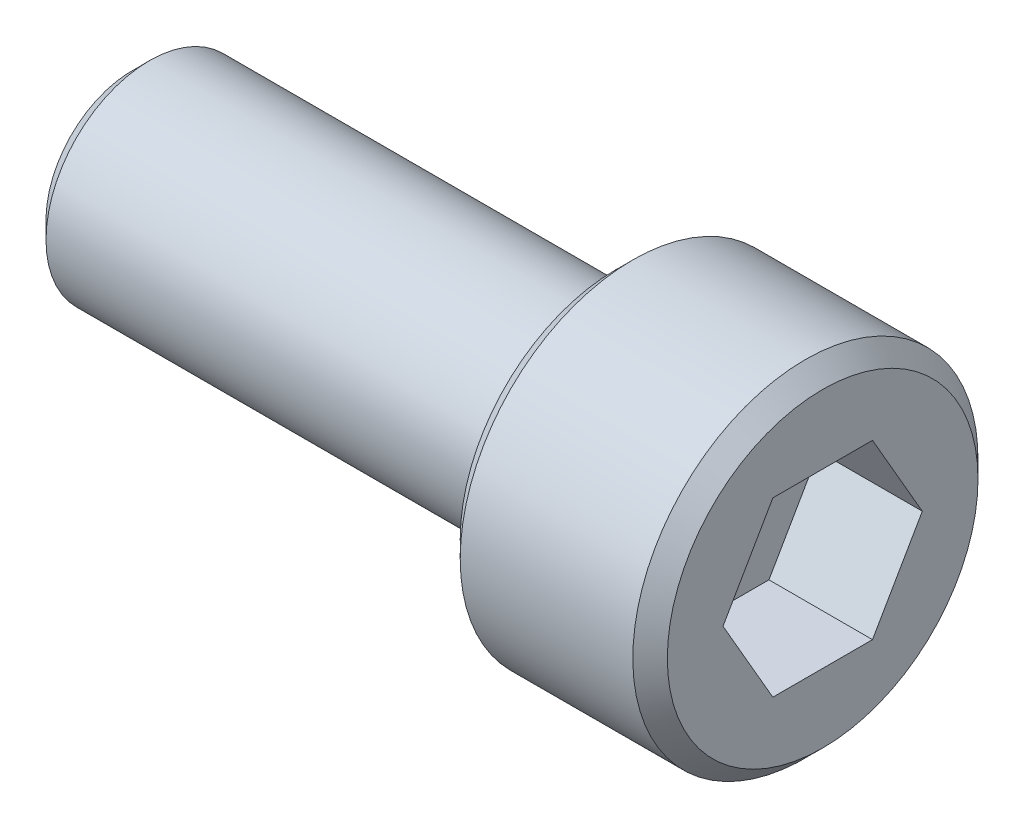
ISO-10303-21;
HEADER;
FILE_DESCRIPTION(('STEP AP214'),'2;1');
FILE_NAME('part.step','',(''),(''),'','','');
FILE_SCHEMA(('AUTOMOTIVE_DESIGN { 1 0 10303 214 1 1 1 1 }'));
ENDSEC;
DATA;
#1=APPLICATION_CONTEXT('core data for automotive mechanical design processes');
#2=APPLICATION_PROTOCOL_DEFINITION('international standard','automotive_design',2000,#1);
#3=PRODUCT_CONTEXT('',#1,'mechanical');
#4=PRODUCT('Part','Part','',(#3));
#5=PRODUCT_RELATED_PRODUCT_CATEGORY('part','',(#4));
#6=PRODUCT_DEFINITION_FORMATION('','',#4);
#7=PRODUCT_DEFINITION_CONTEXT('part definition',#1,'design');
#8=PRODUCT_DEFINITION('design','',#6,#7);
#9=PRODUCT_DEFINITION_SHAPE('','',#8);
#10=(LENGTH_UNIT() NAMED_UNIT(*) SI_UNIT(.MILLI.,.METRE.));
#11=(NAMED_UNIT(*) PLANE_ANGLE_UNIT() SI_UNIT($,.RADIAN.));
#12=(NAMED_UNIT(*) SI_UNIT($,.STERADIAN.) SOLID_ANGLE_UNIT());
#13=UNCERTAINTY_MEASURE_WITH_UNIT(LENGTH_MEASURE(1.E-05),#10,'distance_accuracy_value','');
#14=(GEOMETRIC_REPRESENTATION_CONTEXT(3) GLOBAL_UNCERTAINTY_ASSIGNED_CONTEXT((#13)) GLOBAL_UNIT_ASSIGNED_CONTEXT((#10,
#11,#12)) REPRESENTATION_CONTEXT('',''));
#15=CARTESIAN_POINT('',(0.,0.,0.));
#16=DIRECTION('',(0.,0.,1.));
#17=DIRECTION('',(1.,0.,0.));
#18=AXIS2_PLACEMENT_3D('',#15,#16,#17);
#19=CARTESIAN_POINT('',(-20.,0.,0.));
#20=DIRECTION('',(-1.,0.,0.));
#21=DIRECTION('',(0.,-1.,0.));
#22=AXIS2_PLACEMENT_3D('',#19,#20,#21);
#23=PLANE('',#22);
#24=CARTESIAN_POINT('',(-20.,0.,0.));
#25=DIRECTION('',(-1.,0.,0.));
#26=DIRECTION('',(0.,-1.,0.));
#27=AXIS2_PLACEMENT_3D('',#24,#25,#26);
#28=CIRCLE('',#27,2.5);
#29=CARTESIAN_POINT('',(-20.,-2.5,0.));
#30=VERTEX_POINT('',#29);
#31=EDGE_CURVE('E11',#30,#30,#28,.T.);
#32=ORIENTED_EDGE('',*,*,#31,.T.);
#33=EDGE_LOOP('',(#32));
#34=FACE_BOUND('',#33,.T.);
#35=ADVANCED_FACE('F43',(#34),#23,.T.);
#36=CARTESIAN_POINT('',(0.,0.,0.));
#37=DIRECTION('',(1.,0.,0.));
#38=DIRECTION('',(0.,1.,0.));
#39=AXIS2_PLACEMENT_3D('',#36,#37,#38);
#40=CYLINDRICAL_SURFACE('',#39,2.99999999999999);
#41=CARTESIAN_POINT('',(-19.5,0.,0.));
#42=DIRECTION('',(-1.,0.,0.));
#43=DIRECTION('',(0.,-1.,0.));
#44=AXIS2_PLACEMENT_3D('',#41,#42,#43);
#45=CIRCLE('',#44,2.99999999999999);
#46=CARTESIAN_POINT('',(-19.5,-3.,0.));
#47=VERTEX_POINT('',#46);
#48=EDGE_CURVE('E53',#47,#47,#45,.F.);
#49=ORIENTED_EDGE('',*,*,#48,.T.);
#50=EDGE_LOOP('',(#49));
#51=FACE_BOUND('',#50,.T.);
#52=CARTESIAN_POINT('',(-6.,0.,0.));
#53=DIRECTION('',(1.,0.,0.));
#54=DIRECTION('',(0.,1.,0.));
#55=AXIS2_PLACEMENT_3D('',#52,#53,#54);
#56=CIRCLE('',#55,2.99999999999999);
#57=CARTESIAN_POINT('',(-6.,2.99999999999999,0.));
#58=VERTEX_POINT('',#57);
#59=EDGE_CURVE('E159',#58,#58,#56,.T.);
#60=ORIENTED_EDGE('',*,*,#59,.F.);
#61=EDGE_LOOP('',(#60));
#62=FACE_BOUND('',#61,.T.);
#63=ADVANCED_FACE('F191',(#51,#62),#40,.T.);
#64=CARTESIAN_POINT('',(-6.,2.99999999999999,0.));
#65=DIRECTION('',(-1.,0.,0.));
#66=DIRECTION('',(0.,-1.,0.));
#67=AXIS2_PLACEMENT_3D('',#64,#65,#66);
#68=PLANE('',#67);
#69=CARTESIAN_POINT('',(-6.,0.,0.));
#70=DIRECTION('',(-1.,0.,0.));
#71=DIRECTION('',(0.,-1.,0.));
#72=AXIS2_PLACEMENT_3D('',#69,#70,#71);
#73=CIRCLE('',#72,4.50000000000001);
#74=CARTESIAN_POINT('',(-6.,-4.50000000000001,0.));
#75=VERTEX_POINT('',#74);
#76=EDGE_CURVE('E184',#75,#75,#73,.T.);
#77=ORIENTED_EDGE('',*,*,#76,.T.);
#78=EDGE_LOOP('',(#77));
#79=FACE_BOUND('',#78,.T.);
#80=ORIENTED_EDGE('',*,*,#59,.T.);
#81=EDGE_LOOP('',(#80));
#82=FACE_BOUND('',#81,.T.);
#83=ADVANCED_FACE('F209',(#79,#82),#68,.T.);
#84=CARTESIAN_POINT('',(0.,0.,0.));
#85=DIRECTION('',(1.,0.,0.));
#86=DIRECTION('',(0.,1.,0.));
#87=AXIS2_PLACEMENT_3D('',#84,#85,#86);
#88=CYLINDRICAL_SURFACE('',#87,5.);
#89=CARTESIAN_POINT('',(-0.499999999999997,0.,0.));
#90=DIRECTION('',(1.,0.,0.));
#91=DIRECTION('',(0.,1.,0.));
#92=AXIS2_PLACEMENT_3D('',#89,#90,#91);
#93=CIRCLE('',#92,5.);
#94=CARTESIAN_POINT('',(-0.499999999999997,5.,0.));
#95=VERTEX_POINT('',#94);
#96=EDGE_CURVE('E180',#95,#95,#93,.F.);
#97=ORIENTED_EDGE('',*,*,#96,.T.);
#98=EDGE_LOOP('',(#97));
#99=FACE_BOUND('',#98,.T.);
#100=CARTESIAN_POINT('',(-5.50000000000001,0.,0.));
#101=DIRECTION('',(-1.,0.,0.));
#102=DIRECTION('',(0.,-1.,0.));
#103=AXIS2_PLACEMENT_3D('',#100,#101,#102);
#104=CIRCLE('',#103,5.);
#105=CARTESIAN_POINT('',(-5.50000000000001,-5.,0.));
#106=VERTEX_POINT('',#105);
#107=EDGE_CURVE('E176',#106,#106,#104,.F.);
#108=ORIENTED_EDGE('',*,*,#107,.T.);
#109=EDGE_LOOP('',(#108));
#110=FACE_BOUND('',#109,.T.);
#111=ADVANCED_FACE('F236',(#99,#110),#88,.T.);
#112=CARTESIAN_POINT('',(0.,5.,0.));
#113=DIRECTION('',(1.,0.,0.));
#114=DIRECTION('',(0.,1.,0.));
#115=AXIS2_PLACEMENT_3D('',#112,#113,#114);
#116=PLANE('',#115);
#117=CARTESIAN_POINT('',(0.,0.,0.));
#118=DIRECTION('',(1.,0.,0.));
#119=DIRECTION('',(0.,1.,0.));
#120=AXIS2_PLACEMENT_3D('',#117,#118,#119);
#121=CIRCLE('',#120,4.50000000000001);
#122=CARTESIAN_POINT('',(0.,4.50000000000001,0.));
#123=VERTEX_POINT('',#122);
#124=EDGE_CURVE('E172',#123,#123,#121,.T.);
#125=ORIENTED_EDGE('',*,*,#124,.T.);
#126=EDGE_LOOP('',(#125));
#127=FACE_BOUND('',#126,.T.);
#128=DIRECTION('',(0.,0.866025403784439,-0.5));
#129=VECTOR('',#128,1.);
#130=CARTESIAN_POINT('',(0.,-2.5,-1.44337567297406));
#131=LINE('',#130,#129);
#132=CARTESIAN_POINT('',(0.,-2.5,-1.44337567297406));
#133=VERTEX_POINT('',#132);
#134=CARTESIAN_POINT('',(0.,0.,-2.88675134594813));
#135=VERTEX_POINT('',#134);
#136=EDGE_CURVE('E60',#133,#135,#131,.T.);
#137=ORIENTED_EDGE('',*,*,#136,.F.);
#138=DIRECTION('',(0.,0.,-1.));
#139=VECTOR('',#138,1.);
#140=CARTESIAN_POINT('',(0.,-2.5,1.44337567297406));
#141=LINE('',#140,#139);
#142=CARTESIAN_POINT('',(0.,-2.5,1.44337567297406));
#143=VERTEX_POINT('',#142);
#144=EDGE_CURVE('E153',#143,#133,#141,.T.);
#145=ORIENTED_EDGE('',*,*,#144,.F.);
#146=DIRECTION('',(0.,-0.866025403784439,-0.5));
#147=VECTOR('',#146,1.);
#148=CARTESIAN_POINT('',(0.,0.,2.88675134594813));
#149=LINE('',#148,#147);
#150=CARTESIAN_POINT('',(0.,0.,2.88675134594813));
#151=VERTEX_POINT('',#150);
#152=EDGE_CURVE('E150',#151,#143,#149,.T.);
#153=ORIENTED_EDGE('',*,*,#152,.F.);
#154=DIRECTION('',(0.,-0.866025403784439,0.5));
#155=VECTOR('',#154,1.);
#156=CARTESIAN_POINT('',(0.,2.5,1.44337567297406));
#157=LINE('',#156,#155);
#158=CARTESIAN_POINT('',(0.,2.5,1.44337567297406));
#159=VERTEX_POINT('',#158);
#160=EDGE_CURVE('E108',#159,#151,#157,.T.);
#161=ORIENTED_EDGE('',*,*,#160,.F.);
#162=DIRECTION('',(0.,0.,1.));
#163=VECTOR('',#162,1.);
#164=CARTESIAN_POINT('',(0.,2.5,-1.44337567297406));
#165=LINE('',#164,#163);
#166=CARTESIAN_POINT('',(0.,2.5,-1.44337567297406));
#167=VERTEX_POINT('',#166);
#168=EDGE_CURVE('E144',#167,#159,#165,.T.);
#169=ORIENTED_EDGE('',*,*,#168,.F.);
#170=DIRECTION('',(0.,0.866025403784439,0.5));
#171=VECTOR('',#170,1.);
#172=CARTESIAN_POINT('',(0.,0.,-2.88675134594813));
#173=LINE('',#172,#171);
#174=EDGE_CURVE('E140',#135,#167,#173,.T.);
#175=ORIENTED_EDGE('',*,*,#174,.F.);
#176=EDGE_LOOP('',(#137,#145,#153,#161,#169,#175));
#177=FACE_BOUND('',#176,.T.);
#178=ADVANCED_FACE('F232',(#127,#177),#116,.T.);
#179=CARTESIAN_POINT('',(-3.,-2.5,-1.44337567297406));
#180=DIRECTION('',(0.,-0.5,-0.866025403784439));
#181=DIRECTION('',(0.,0.866025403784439,-0.5));
#182=AXIS2_PLACEMENT_3D('',#179,#180,#181);
#183=PLANE('',#182);
#184=ORIENTED_EDGE('',*,*,#136,.T.);
#185=DIRECTION('',(1.,0.,0.));
#186=VECTOR('',#185,1.);
#187=CARTESIAN_POINT('',(-3.,0.,-2.88675134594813));
#188=LINE('',#187,#186);
#189=CARTESIAN_POINT('',(-3.,0.,-2.88675134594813));
#190=VERTEX_POINT('',#189);
#191=EDGE_CURVE('E90',#190,#135,#188,.T.);
#192=ORIENTED_EDGE('',*,*,#191,.F.);
#193=DIRECTION('',(0.,0.866025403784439,-0.5));
#194=VECTOR('',#193,1.);
#195=CARTESIAN_POINT('',(-3.,-2.5,-1.44337567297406));
#196=LINE('',#195,#194);
#197=CARTESIAN_POINT('',(-3.,-2.5,-1.44337567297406));
#198=VERTEX_POINT('',#197);
#199=EDGE_CURVE('E156',#198,#190,#196,.T.);
#200=ORIENTED_EDGE('',*,*,#199,.F.);
#201=DIRECTION('',(1.,0.,0.));
#202=VECTOR('',#201,1.);
#203=CARTESIAN_POINT('',(-3.,-2.5,-1.44337567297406));
#204=LINE('',#203,#202);
#205=EDGE_CURVE('E68',#198,#133,#204,.T.);
#206=ORIENTED_EDGE('',*,*,#205,.T.);
#207=EDGE_LOOP('',(#184,#192,#200,#206));
#208=FACE_BOUND('',#207,.T.);
#209=ADVANCED_FACE('F235',(#208),#183,.F.);
#210=CARTESIAN_POINT('',(-3.,-2.5,1.44337567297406));
#211=DIRECTION('',(0.,-1.,0.));
#212=DIRECTION('',(1.,0.,0.));
#213=AXIS2_PLACEMENT_3D('',#210,#211,#212);
#214=PLANE('',#213);
#215=ORIENTED_EDGE('',*,*,#144,.T.);
#216=ORIENTED_EDGE('',*,*,#205,.F.);
#217=DIRECTION('',(0.,0.,-1.));
#218=VECTOR('',#217,1.);
#219=CARTESIAN_POINT('',(-3.,-2.5,1.44337567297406));
#220=LINE('',#219,#218);
#221=CARTESIAN_POINT('',(-3.,-2.5,1.44337567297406));
#222=VERTEX_POINT('',#221);
#223=EDGE_CURVE('E122',#222,#198,#220,.T.);
#224=ORIENTED_EDGE('',*,*,#223,.F.);
#225=DIRECTION('',(1.,0.,0.));
#226=VECTOR('',#225,1.);
#227=CARTESIAN_POINT('',(-3.,-2.5,1.44337567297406));
#228=LINE('',#227,#226);
#229=EDGE_CURVE('E113',#222,#143,#228,.T.);
#230=ORIENTED_EDGE('',*,*,#229,.T.);
#231=EDGE_LOOP('',(#215,#216,#224,#230));
#232=FACE_BOUND('',#231,.T.);
#233=ADVANCED_FACE('F246',(#232),#214,.F.);
#234=CARTESIAN_POINT('',(-3.,0.,2.88675134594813));
#235=DIRECTION('',(0.,-0.5,0.866025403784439));
#236=DIRECTION('',(0.,-0.866025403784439,-0.5));
#237=AXIS2_PLACEMENT_3D('',#234,#235,#236);
#238=PLANE('',#237);
#239=ORIENTED_EDGE('',*,*,#152,.T.);
#240=ORIENTED_EDGE('',*,*,#229,.F.);
#241=DIRECTION('',(0.,-0.866025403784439,-0.5));
#242=VECTOR('',#241,1.);
#243=CARTESIAN_POINT('',(-3.,0.,2.88675134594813));
#244=LINE('',#243,#242);
#245=CARTESIAN_POINT('',(-3.,0.,2.88675134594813));
#246=VERTEX_POINT('',#245);
#247=EDGE_CURVE('E117',#246,#222,#244,.T.);
#248=ORIENTED_EDGE('',*,*,#247,.F.);
#249=DIRECTION('',(1.,0.,0.));
#250=VECTOR('',#249,1.);
#251=CARTESIAN_POINT('',(-3.,0.,2.88675134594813));
#252=LINE('',#251,#250);
#253=EDGE_CURVE('E101',#246,#151,#252,.T.);
#254=ORIENTED_EDGE('',*,*,#253,.T.);
#255=EDGE_LOOP('',(#239,#240,#248,#254));
#256=FACE_BOUND('',#255,.T.);
#257=ADVANCED_FACE('F118',(#256),#238,.F.);
#258=CARTESIAN_POINT('',(-3.,2.5,1.44337567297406));
#259=DIRECTION('',(0.,0.5,0.866025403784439));
#260=DIRECTION('',(0.,-0.866025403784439,0.5));
#261=AXIS2_PLACEMENT_3D('',#258,#259,#260);
#262=PLANE('',#261);
#263=ORIENTED_EDGE('',*,*,#160,.T.);
#264=ORIENTED_EDGE('',*,*,#253,.F.);
#265=DIRECTION('',(0.,-0.866025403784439,0.5));
#266=VECTOR('',#265,1.);
#267=CARTESIAN_POINT('',(-3.,2.5,1.44337567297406));
#268=LINE('',#267,#266);
#269=CARTESIAN_POINT('',(-3.,2.5,1.44337567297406));
#270=VERTEX_POINT('',#269);
#271=EDGE_CURVE('E105',#270,#246,#268,.T.);
#272=ORIENTED_EDGE('',*,*,#271,.F.);
#273=DIRECTION('',(1.,0.,0.));
#274=VECTOR('',#273,1.);
#275=CARTESIAN_POINT('',(-3.,2.5,1.44337567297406));
#276=LINE('',#275,#274);
#277=EDGE_CURVE('E114',#270,#159,#276,.T.);
#278=ORIENTED_EDGE('',*,*,#277,.T.);
#279=EDGE_LOOP('',(#263,#264,#272,#278));
#280=FACE_BOUND('',#279,.T.);
#281=ADVANCED_FACE('F103',(#280),#262,.F.);
#282=CARTESIAN_POINT('',(-3.,2.5,-1.44337567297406));
#283=DIRECTION('',(0.,1.,0.));
#284=DIRECTION('',(-1.,0.,0.));
#285=AXIS2_PLACEMENT_3D('',#282,#283,#284);
#286=PLANE('',#285);
#287=ORIENTED_EDGE('',*,*,#168,.T.);
#288=ORIENTED_EDGE('',*,*,#277,.F.);
#289=DIRECTION('',(0.,0.,1.));
#290=VECTOR('',#289,1.);
#291=CARTESIAN_POINT('',(-3.,2.5,-1.44337567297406));
#292=LINE('',#291,#290);
#293=CARTESIAN_POINT('',(-3.,2.5,-1.44337567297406));
#294=VERTEX_POINT('',#293);
#295=EDGE_CURVE('E128',#294,#270,#292,.T.);
#296=ORIENTED_EDGE('',*,*,#295,.F.);
#297=DIRECTION('',(1.,0.,0.));
#298=VECTOR('',#297,1.);
#299=CARTESIAN_POINT('',(-3.,2.5,-1.44337567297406));
#300=LINE('',#299,#298);
#301=EDGE_CURVE('E164',#294,#167,#300,.T.);
#302=ORIENTED_EDGE('',*,*,#301,.T.);
#303=EDGE_LOOP('',(#287,#288,#296,#302));
#304=FACE_BOUND('',#303,.T.);
#305=ADVANCED_FACE('F308',(#304),#286,.F.);
#306=CARTESIAN_POINT('',(-3.,0.,-2.88675134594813));
#307=DIRECTION('',(0.,0.5,-0.866025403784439));
#308=DIRECTION('',(0.,0.866025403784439,0.5));
#309=AXIS2_PLACEMENT_3D('',#306,#307,#308);
#310=PLANE('',#309);
#311=ORIENTED_EDGE('',*,*,#174,.T.);
#312=ORIENTED_EDGE('',*,*,#301,.F.);
#313=DIRECTION('',(0.,0.866025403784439,0.5));
#314=VECTOR('',#313,1.);
#315=CARTESIAN_POINT('',(-3.,0.,-2.88675134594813));
#316=LINE('',#315,#314);
#317=EDGE_CURVE('E132',#190,#294,#316,.T.);
#318=ORIENTED_EDGE('',*,*,#317,.F.);
#319=ORIENTED_EDGE('',*,*,#191,.T.);
#320=EDGE_LOOP('',(#311,#312,#318,#319));
#321=FACE_BOUND('',#320,.T.);
#322=ADVANCED_FACE('F226',(#321),#310,.F.);
#323=CARTESIAN_POINT('',(-3.,0.,0.));
#324=DIRECTION('',(1.,0.,0.));
#325=DIRECTION('',(0.,1.,0.));
#326=AXIS2_PLACEMENT_3D('',#323,#324,#325);
#327=PLANE('',#326);
#328=ORIENTED_EDGE('',*,*,#199,.T.);
#329=ORIENTED_EDGE('',*,*,#317,.T.);
#330=ORIENTED_EDGE('',*,*,#295,.T.);
#331=ORIENTED_EDGE('',*,*,#271,.T.);
#332=ORIENTED_EDGE('',*,*,#247,.T.);
#333=ORIENTED_EDGE('',*,*,#223,.T.);
#334=EDGE_LOOP('',(#328,#329,#330,#331,#332,#333));
#335=FACE_BOUND('',#334,.T.);
#336=ADVANCED_FACE('F125',(#335),#327,.T.);
#337=CARTESIAN_POINT('',(0.,0.,0.));
#338=DIRECTION('',(-1.,0.,0.));
#339=DIRECTION('',(0.,-1.,0.));
#340=AXIS2_PLACEMENT_3D('',#337,#338,#339);
#341=CONICAL_SURFACE('',#340,4.50000000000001,0.785398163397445);
#342=ORIENTED_EDGE('',*,*,#96,.F.);
#343=EDGE_LOOP('',(#342));
#344=FACE_BOUND('',#343,.T.);
#345=ORIENTED_EDGE('',*,*,#124,.F.);
#346=EDGE_LOOP('',(#345));
#347=FACE_BOUND('',#346,.T.);
#348=ADVANCED_FACE('F200',(#344,#347),#341,.T.);
#349=CARTESIAN_POINT('',(-5.50000000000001,0.,0.));
#350=DIRECTION('',(1.,0.,0.));
#351=DIRECTION('',(0.,1.,0.));
#352=AXIS2_PLACEMENT_3D('',#349,#350,#351);
#353=CONICAL_SURFACE('',#352,5.,0.785398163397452);
#354=ORIENTED_EDGE('',*,*,#76,.F.);
#355=EDGE_LOOP('',(#354));
#356=FACE_BOUND('',#355,.T.);
#357=ORIENTED_EDGE('',*,*,#107,.F.);
#358=EDGE_LOOP('',(#357));
#359=FACE_BOUND('',#358,.T.);
#360=ADVANCED_FACE('F195',(#356,#359),#353,.T.);
#361=CARTESIAN_POINT('',(-19.5,0.,0.));
#362=DIRECTION('',(1.,0.,0.));
#363=DIRECTION('',(0.,1.,0.));
#364=AXIS2_PLACEMENT_3D('',#361,#362,#363);
#365=CONICAL_SURFACE('',#364,2.99999999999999,0.785398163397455);
#366=ORIENTED_EDGE('',*,*,#31,.F.);
#367=EDGE_LOOP('',(#366));
#368=FACE_BOUND('',#367,.T.);
#369=ORIENTED_EDGE('',*,*,#48,.F.);
#370=EDGE_LOOP('',(#369));
#371=FACE_BOUND('',#370,.T.);
#372=ADVANCED_FACE('F46',(#368,#371),#365,.T.);
#373=CLOSED_SHELL('',(#35,#63,#83,#111,#178,#209,#233,#257,#281,#305,#322,#336,#348,#360,#372));
#374=MANIFOLD_SOLID_BREP('B2',#373);
#375=ADVANCED_BREP_SHAPE_REPRESENTATION('',(#18,#374),#14);
#376=SHAPE_DEFINITION_REPRESENTATION(#9,#375);
ENDSEC;
END-ISO-10303-21;
